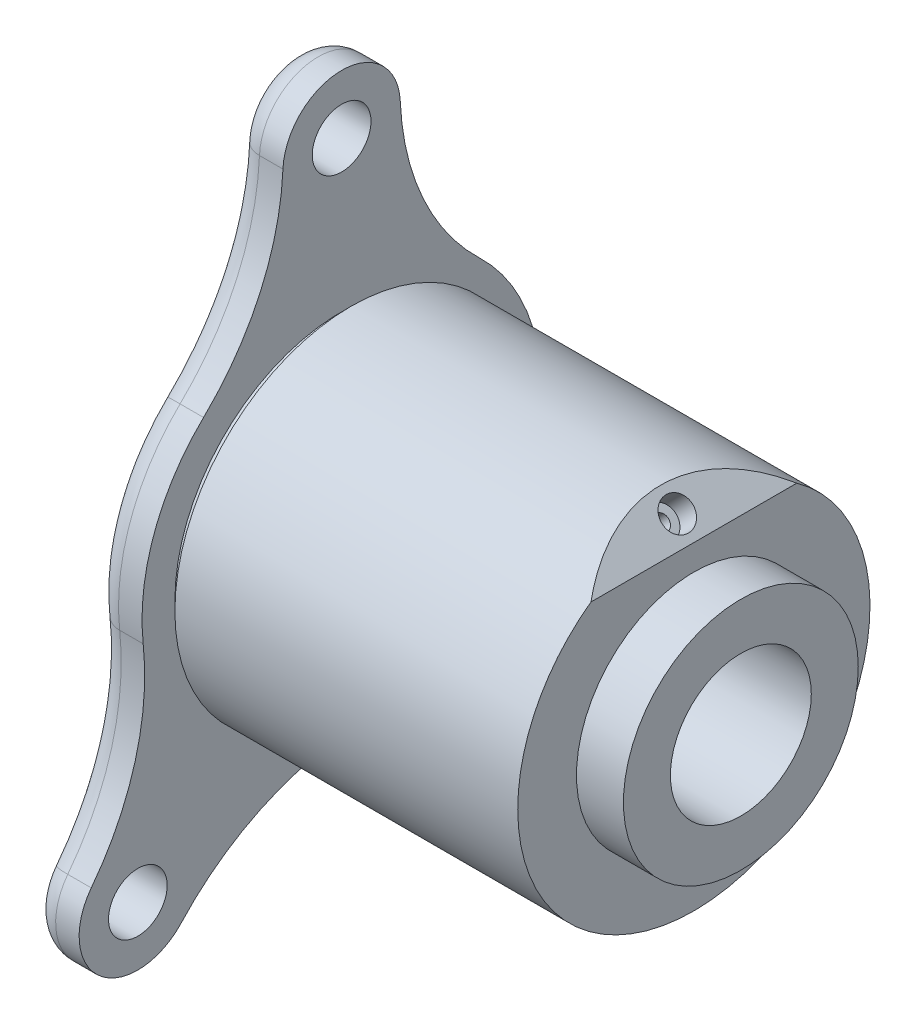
ISO-10303-21;
HEADER;
FILE_DESCRIPTION(('STEP AP214'),'2;1');
FILE_NAME('part.step','',(''),(''),'','','');
FILE_SCHEMA(('AUTOMOTIVE_DESIGN { 1 0 10303 214 1 1 1 1 }'));
ENDSEC;
DATA;
#1=APPLICATION_CONTEXT('core data for automotive mechanical design processes');
#2=APPLICATION_PROTOCOL_DEFINITION('international standard','automotive_design',2000,#1);
#3=PRODUCT_CONTEXT('',#1,'mechanical');
#4=PRODUCT('Part','Part','',(#3));
#5=PRODUCT_RELATED_PRODUCT_CATEGORY('part','',(#4));
#6=PRODUCT_DEFINITION_FORMATION('','',#4);
#7=PRODUCT_DEFINITION_CONTEXT('part definition',#1,'design');
#8=PRODUCT_DEFINITION('design','',#6,#7);
#9=PRODUCT_DEFINITION_SHAPE('','',#8);
#10=(LENGTH_UNIT() NAMED_UNIT(*) SI_UNIT(.MILLI.,.METRE.));
#11=(NAMED_UNIT(*) PLANE_ANGLE_UNIT() SI_UNIT($,.RADIAN.));
#12=(NAMED_UNIT(*) SI_UNIT($,.STERADIAN.) SOLID_ANGLE_UNIT());
#13=UNCERTAINTY_MEASURE_WITH_UNIT(LENGTH_MEASURE(1.E-05),#10,'distance_accuracy_value','');
#14=(GEOMETRIC_REPRESENTATION_CONTEXT(3) GLOBAL_UNCERTAINTY_ASSIGNED_CONTEXT((#13)) GLOBAL_UNIT_ASSIGNED_CONTEXT((#10,
#11,#12)) REPRESENTATION_CONTEXT('',''));
#15=CARTESIAN_POINT('',(0.,0.,0.));
#16=DIRECTION('',(0.,0.,1.));
#17=DIRECTION('',(1.,0.,0.));
#18=AXIS2_PLACEMENT_3D('',#15,#16,#17);
#19=CARTESIAN_POINT('',(75.,0.,0.));
#20=DIRECTION('',(-1.,0.,0.));
#21=DIRECTION('',(0.,0.,1.));
#22=AXIS2_PLACEMENT_3D('',#19,#20,#21);
#23=CYLINDRICAL_SURFACE('',#22,37.5);
#24=CARTESIAN_POINT('',(2.,0.,0.));
#25=DIRECTION('',(-1.,0.,0.));
#26=DIRECTION('',(0.,0.,1.));
#27=AXIS2_PLACEMENT_3D('',#24,#25,#26);
#28=CIRCLE('',#27,37.5);
#29=CARTESIAN_POINT('',(2.,0.,37.5));
#30=VERTEX_POINT('',#29);
#31=EDGE_CURVE('E365',#30,#30,#28,.T.);
#32=ORIENTED_EDGE('',*,*,#31,.F.);
#33=EDGE_LOOP('',(#32));
#34=FACE_BOUND('',#33,.T.);
#35=CARTESIAN_POINT('',(75.,0.,0.));
#36=DIRECTION('',(1.,0.,0.));
#37=DIRECTION('',(0.,0.,-1.));
#38=AXIS2_PLACEMENT_3D('',#35,#36,#37);
#39=CIRCLE('',#38,37.5);
#40=CARTESIAN_POINT('',(75.,30.4289321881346,21.9164341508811));
#41=VERTEX_POINT('',#40);
#42=CARTESIAN_POINT('',(75.,30.4289321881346,-21.9164341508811));
#43=VERTEX_POINT('',#42);
#44=EDGE_CURVE('E124',#41,#43,#39,.T.);
#45=ORIENTED_EDGE('',*,*,#44,.F.);
#46=CARTESIAN_POINT('',(105.428932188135,0.,0.));
#47=DIRECTION('',(0.707106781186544,0.707106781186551,0.));
#48=DIRECTION('',(-0.707106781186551,0.707106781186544,0.));
#49=AXIS2_PLACEMENT_3D('',#46,#47,#48);
#50=ELLIPSE('',#49,53.0330085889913,37.5);
#51=EDGE_CURVE('E41',#43,#41,#50,.T.);
#52=ORIENTED_EDGE('',*,*,#51,.F.);
#53=EDGE_LOOP('',(#45,#52));
#54=FACE_BOUND('',#53,.T.);
#55=ADVANCED_FACE('F28',(#34,#54),#23,.T.);
#56=CARTESIAN_POINT('',(75.,0.,0.));
#57=DIRECTION('',(1.,0.,0.));
#58=DIRECTION('',(0.,0.,-1.));
#59=AXIS2_PLACEMENT_3D('',#56,#57,#58);
#60=PLANE('',#59);
#61=CARTESIAN_POINT('',(75.,0.,0.));
#62=DIRECTION('',(1.,0.,0.));
#63=DIRECTION('',(0.,0.,-1.));
#64=AXIS2_PLACEMENT_3D('',#61,#62,#63);
#65=CIRCLE('',#64,25.);
#66=CARTESIAN_POINT('',(75.,0.,-25.));
#67=VERTEX_POINT('',#66);
#68=EDGE_CURVE('E136',#67,#67,#65,.T.);
#69=ORIENTED_EDGE('',*,*,#68,.F.);
#70=EDGE_LOOP('',(#69));
#71=FACE_BOUND('',#70,.T.);
#72=ORIENTED_EDGE('',*,*,#44,.T.);
#73=DIRECTION('',(0.,0.,1.));
#74=VECTOR('',#73,1.);
#75=CARTESIAN_POINT('',(75.,30.4289321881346,0.));
#76=LINE('',#75,#74);
#77=EDGE_CURVE('E11',#43,#41,#76,.T.);
#78=ORIENTED_EDGE('',*,*,#77,.T.);
#79=EDGE_LOOP('',(#72,#78));
#80=FACE_BOUND('',#79,.T.);
#81=ADVANCED_FACE('F128',(#71,#80),#60,.T.);
#82=CARTESIAN_POINT('',(-10.,35.2083333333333,33.7184780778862));
#83=DIRECTION('',(-1.,0.,0.));
#84=DIRECTION('',(0.,0.,1.));
#85=AXIS2_PLACEMENT_3D('',#82,#83,#84);
#86=PLANE('',#85);
#87=CARTESIAN_POINT('',(-10.,0.,0.));
#88=DIRECTION('',(-1.,0.,0.));
#89=DIRECTION('',(0.,0.,1.));
#90=AXIS2_PLACEMENT_3D('',#87,#88,#89);
#91=CIRCLE('',#90,37.5);
#92=CARTESIAN_POINT('',(-10.,27.0833333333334,-25.9372908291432));
#93=VERTEX_POINT('',#92);
#94=CARTESIAN_POINT('',(-10.,-37.4192061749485,-2.46028641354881));
#95=VERTEX_POINT('',#94);
#96=EDGE_CURVE('E149',#93,#95,#91,.T.);
#97=ORIENTED_EDGE('',*,*,#96,.T.);
#98=CARTESIAN_POINT('',(-10.,-97.2899360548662,-6.39674467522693));
#99=DIRECTION('',(-1.,0.,0.));
#100=DIRECTION('',(0.,0.,1.));
#101=AXIS2_PLACEMENT_3D('',#98,#99,#100);
#102=CIRCLE('',#101,60.);
#103=CARTESIAN_POINT('',(-10.,-56.7726594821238,37.8565071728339));
#104=VERTEX_POINT('',#103);
#105=EDGE_CURVE('E153',#95,#104,#102,.F.);
#106=ORIENTED_EDGE('',*,*,#105,.T.);
#107=CARTESIAN_POINT('',(-10.,-51.707999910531,43.3881636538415));
#108=DIRECTION('',(-1.,0.,0.));
#109=DIRECTION('',(0.,0.,1.));
#110=AXIS2_PLACEMENT_3D('',#107,#108,#109);
#111=CIRCLE('',#110,7.5);
#112=CARTESIAN_POINT('',(-10.,-47.1398506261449,49.33644173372));
#113=VERTEX_POINT('',#112);
#114=EDGE_CURVE('E151',#104,#113,#111,.T.);
#115=ORIENTED_EDGE('',*,*,#114,.T.);
#116=CARTESIAN_POINT('',(-10.,-10.5946563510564,96.922666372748));
#117=DIRECTION('',(-1.,0.,0.));
#118=DIRECTION('',(0.,0.,1.));
#119=AXIS2_PLACEMENT_3D('',#116,#117,#118);
#120=CIRCLE('',#119,60.);
#121=CARTESIAN_POINT('',(-10.,-4.0748678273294,37.2779486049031));
#122=VERTEX_POINT('',#121);
#123=EDGE_CURVE('E147',#113,#122,#120,.F.);
#124=ORIENTED_EDGE('',*,*,#123,.T.);
#125=CARTESIAN_POINT('',(-10.,0.,0.));
#126=DIRECTION('',(-1.,0.,0.));
#127=DIRECTION('',(0.,0.,1.));
#128=AXIS2_PLACEMENT_3D('',#125,#126,#127);
#129=CIRCLE('',#128,37.5);
#130=CARTESIAN_POINT('',(-10.,27.0833333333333,25.9372908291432));
#131=VERTEX_POINT('',#130);
#132=EDGE_CURVE('E143',#122,#131,#129,.T.);
#133=ORIENTED_EDGE('',*,*,#132,.T.);
#134=CARTESIAN_POINT('',(-10.,70.4166666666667,67.4369561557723));
#135=DIRECTION('',(-1.,0.,0.));
#136=DIRECTION('',(0.,0.,1.));
#137=AXIS2_PLACEMENT_3D('',#134,#135,#136);
#138=CIRCLE('',#137,60.);
#139=CARTESIAN_POINT('',(-10.,67.8240740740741,7.49299512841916));
#140=VERTEX_POINT('',#139);
#141=EDGE_CURVE('E133',#131,#140,#138,.F.);
#142=ORIENTED_EDGE('',*,*,#141,.T.);
#143=CARTESIAN_POINT('',(-10.,67.5,0.));
#144=DIRECTION('',(-1.,0.,0.));
#145=DIRECTION('',(0.,0.,1.));
#146=AXIS2_PLACEMENT_3D('',#143,#144,#145);
#147=CIRCLE('',#146,7.5);
#148=CARTESIAN_POINT('',(-10.,67.8240740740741,-7.49299512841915));
#149=VERTEX_POINT('',#148);
#150=EDGE_CURVE('E141',#140,#149,#147,.T.);
#151=ORIENTED_EDGE('',*,*,#150,.T.);
#152=CARTESIAN_POINT('',(-10.,70.4166666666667,-67.4369561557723));
#153=DIRECTION('',(-1.,0.,0.));
#154=DIRECTION('',(0.,0.,1.));
#155=AXIS2_PLACEMENT_3D('',#152,#153,#154);
#156=CIRCLE('',#155,60.);
#157=EDGE_CURVE('E145',#149,#93,#156,.F.);
#158=ORIENTED_EDGE('',*,*,#157,.T.);
#159=EDGE_LOOP('',(#97,#106,#115,#124,#133,#142,#151,#158));
#160=FACE_BOUND('',#159,.T.);
#161=CARTESIAN_POINT('',(-10.,0.,0.));
#162=DIRECTION('',(-1.,0.,0.));
#163=DIRECTION('',(0.,0.,1.));
#164=AXIS2_PLACEMENT_3D('',#161,#162,#163);
#165=CIRCLE('',#164,29.3301270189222);
#166=CARTESIAN_POINT('',(-10.,0.,29.3301270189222));
#167=VERTEX_POINT('',#166);
#168=EDGE_CURVE('E129',#167,#167,#165,.F.);
#169=ORIENTED_EDGE('',*,*,#168,.T.);
#170=EDGE_LOOP('',(#169));
#171=FACE_BOUND('',#170,.T.);
#172=CARTESIAN_POINT('',(-10.,67.5,0.));
#173=DIRECTION('',(1.,0.,0.));
#174=DIRECTION('',(0.,0.,-1.));
#175=AXIS2_PLACEMENT_3D('',#172,#173,#174);
#176=CIRCLE('',#175,6.25);
#177=CARTESIAN_POINT('',(-10.,67.5,-6.25));
#178=VERTEX_POINT('',#177);
#179=EDGE_CURVE('E392',#178,#178,#176,.T.);
#180=ORIENTED_EDGE('',*,*,#179,.T.);
#181=EDGE_LOOP('',(#180));
#182=FACE_BOUND('',#181,.T.);
#183=CARTESIAN_POINT('',(-10.,-51.707999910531,43.3881636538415));
#184=DIRECTION('',(1.,0.,0.));
#185=DIRECTION('',(0.,0.,-1.));
#186=AXIS2_PLACEMENT_3D('',#183,#184,#185);
#187=CIRCLE('',#186,6.24999999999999);
#188=CARTESIAN_POINT('',(-10.,-51.707999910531,37.1381636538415));
#189=VERTEX_POINT('',#188);
#190=EDGE_CURVE('E386',#189,#189,#187,.T.);
#191=ORIENTED_EDGE('',*,*,#190,.T.);
#192=EDGE_LOOP('',(#191));
#193=FACE_BOUND('',#192,.T.);
#194=ADVANCED_FACE('F242',(#160,#171,#182,#193),#86,.T.);
#195=CARTESIAN_POINT('',(85.,0.,0.));
#196=DIRECTION('',(-1.,0.,0.));
#197=DIRECTION('',(0.,0.,1.));
#198=AXIS2_PLACEMENT_3D('',#195,#196,#197);
#199=CYLINDRICAL_SURFACE('',#198,25.);
#200=CARTESIAN_POINT('',(85.,0.,0.));
#201=DIRECTION('',(1.,0.,0.));
#202=DIRECTION('',(0.,0.,-1.));
#203=AXIS2_PLACEMENT_3D('',#200,#201,#202);
#204=CIRCLE('',#203,25.);
#205=CARTESIAN_POINT('',(85.,0.,-25.));
#206=VERTEX_POINT('',#205);
#207=EDGE_CURVE('E130',#206,#206,#204,.T.);
#208=ORIENTED_EDGE('',*,*,#207,.F.);
#209=EDGE_LOOP('',(#208));
#210=FACE_BOUND('',#209,.T.);
#211=ORIENTED_EDGE('',*,*,#68,.T.);
#212=EDGE_LOOP('',(#211));
#213=FACE_BOUND('',#212,.T.);
#214=ADVANCED_FACE('F239',(#210,#213),#199,.T.);
#215=CARTESIAN_POINT('',(85.,0.,0.));
#216=DIRECTION('',(1.,0.,0.));
#217=DIRECTION('',(0.,0.,-1.));
#218=AXIS2_PLACEMENT_3D('',#215,#216,#217);
#219=PLANE('',#218);
#220=CARTESIAN_POINT('',(85.,0.,0.));
#221=DIRECTION('',(1.,0.,0.));
#222=DIRECTION('',(0.,0.,-1.));
#223=AXIS2_PLACEMENT_3D('',#220,#221,#222);
#224=CIRCLE('',#223,15.);
#225=CARTESIAN_POINT('',(85.,0.,-15.));
#226=VERTEX_POINT('',#225);
#227=EDGE_CURVE('E374',#226,#226,#224,.T.);
#228=ORIENTED_EDGE('',*,*,#227,.F.);
#229=EDGE_LOOP('',(#228));
#230=FACE_BOUND('',#229,.T.);
#231=ORIENTED_EDGE('',*,*,#207,.T.);
#232=EDGE_LOOP('',(#231));
#233=FACE_BOUND('',#232,.T.);
#234=ADVANCED_FACE('F254',(#230,#233),#219,.T.);
#235=CARTESIAN_POINT('',(0.,35.2083333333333,33.7184780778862));
#236=DIRECTION('',(-1.,0.,0.));
#237=DIRECTION('',(0.,0.,1.));
#238=AXIS2_PLACEMENT_3D('',#235,#236,#237);
#239=PLANE('',#238);
#240=CARTESIAN_POINT('',(0.,-51.707999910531,43.3881636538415));
#241=DIRECTION('',(1.,0.,0.));
#242=DIRECTION('',(0.,0.,-1.));
#243=AXIS2_PLACEMENT_3D('',#240,#241,#242);
#244=CIRCLE('',#243,6.24999999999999);
#245=CARTESIAN_POINT('',(0.,-51.707999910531,37.1381636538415));
#246=VERTEX_POINT('',#245);
#247=EDGE_CURVE('E383',#246,#246,#244,.T.);
#248=ORIENTED_EDGE('',*,*,#247,.F.);
#249=EDGE_LOOP('',(#248));
#250=FACE_BOUND('',#249,.T.);
#251=CARTESIAN_POINT('',(0.,67.5,0.));
#252=DIRECTION('',(1.,0.,0.));
#253=DIRECTION('',(0.,0.,-1.));
#254=AXIS2_PLACEMENT_3D('',#251,#252,#253);
#255=CIRCLE('',#254,6.25);
#256=CARTESIAN_POINT('',(0.,67.5,-6.25));
#257=VERTEX_POINT('',#256);
#258=EDGE_CURVE('E389',#257,#257,#255,.T.);
#259=ORIENTED_EDGE('',*,*,#258,.F.);
#260=EDGE_LOOP('',(#259));
#261=FACE_BOUND('',#260,.T.);
#262=CARTESIAN_POINT('',(0.,70.4166666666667,67.4369561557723));
#263=DIRECTION('',(1.,0.,0.));
#264=DIRECTION('',(0.,0.,1.));
#265=AXIS2_PLACEMENT_3D('',#262,#263,#264);
#266=CIRCLE('',#265,55.);
#267=CARTESIAN_POINT('',(0.,30.6944444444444,29.395596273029));
#268=VERTEX_POINT('',#267);
#269=CARTESIAN_POINT('',(0.,68.0401234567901,12.4883252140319));
#270=VERTEX_POINT('',#269);
#271=EDGE_CURVE('E395',#268,#270,#266,.T.);
#272=ORIENTED_EDGE('',*,*,#271,.F.);
#273=CARTESIAN_POINT('',(0.,0.,0.));
#274=DIRECTION('',(-1.,0.,0.));
#275=DIRECTION('',(0.,0.,1.));
#276=AXIS2_PLACEMENT_3D('',#273,#274,#275);
#277=CIRCLE('',#276,42.5);
#278=CARTESIAN_POINT('',(0.,-4.61818353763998,42.2483417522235));
#279=VERTEX_POINT('',#278);
#280=EDGE_CURVE('E186',#279,#268,#277,.T.);
#281=ORIENTED_EDGE('',*,*,#280,.F.);
#282=CARTESIAN_POINT('',(0.,-10.5946563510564,96.922666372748));
#283=DIRECTION('',(1.,0.,0.));
#284=DIRECTION('',(0.,0.,1.));
#285=AXIS2_PLACEMENT_3D('',#282,#283,#284);
#286=CIRCLE('',#285,55.);
#287=CARTESIAN_POINT('',(0.,-44.0944177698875,53.301960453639));
#288=VERTEX_POINT('',#287);
#289=EDGE_CURVE('E410',#288,#279,#286,.T.);
#290=ORIENTED_EDGE('',*,*,#289,.F.);
#291=CARTESIAN_POINT('',(0.,-51.707999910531,43.3881636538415));
#292=DIRECTION('',(-1.,0.,0.));
#293=DIRECTION('',(0.,0.,1.));
#294=AXIS2_PLACEMENT_3D('',#291,#292,#293);
#295=CIRCLE('',#294,12.5);
#296=CARTESIAN_POINT('',(0.,-60.149099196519,34.1687361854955));
#297=VERTEX_POINT('',#296);
#298=EDGE_CURVE('E223',#297,#288,#295,.T.);
#299=ORIENTED_EDGE('',*,*,#298,.F.);
#300=CARTESIAN_POINT('',(0.,-97.2899360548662,-6.39674467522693));
#301=DIRECTION('',(1.,0.,0.));
#302=DIRECTION('',(0.,0.,1.));
#303=AXIS2_PLACEMENT_3D('',#300,#301,#302);
#304=CIRCLE('',#303,55.);
#305=CARTESIAN_POINT('',(0.,-42.4084336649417,-2.78832460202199));
#306=VERTEX_POINT('',#305);
#307=EDGE_CURVE('E406',#306,#297,#304,.T.);
#308=ORIENTED_EDGE('',*,*,#307,.F.);
#309=CARTESIAN_POINT('',(0.,0.,0.));
#310=DIRECTION('',(-1.,0.,0.));
#311=DIRECTION('',(0.,0.,1.));
#312=AXIS2_PLACEMENT_3D('',#309,#310,#311);
#313=CIRCLE('',#312,42.5);
#314=CARTESIAN_POINT('',(0.,30.6944444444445,-29.3955962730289));
#315=VERTEX_POINT('',#314);
#316=EDGE_CURVE('E403',#315,#306,#313,.T.);
#317=ORIENTED_EDGE('',*,*,#316,.F.);
#318=CARTESIAN_POINT('',(0.,70.4166666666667,-67.4369561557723));
#319=DIRECTION('',(1.,0.,0.));
#320=DIRECTION('',(0.,0.,-1.));
#321=AXIS2_PLACEMENT_3D('',#318,#319,#320);
#322=CIRCLE('',#321,55.);
#323=CARTESIAN_POINT('',(0.,68.0401234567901,-12.4883252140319));
#324=VERTEX_POINT('',#323);
#325=EDGE_CURVE('E400',#324,#315,#322,.T.);
#326=ORIENTED_EDGE('',*,*,#325,.F.);
#327=CARTESIAN_POINT('',(0.,67.5,0.));
#328=DIRECTION('',(-1.,0.,0.));
#329=DIRECTION('',(0.,0.,1.));
#330=AXIS2_PLACEMENT_3D('',#327,#328,#329);
#331=CIRCLE('',#330,12.5);
#332=EDGE_CURVE('E397',#270,#324,#331,.T.);
#333=ORIENTED_EDGE('',*,*,#332,.F.);
#334=EDGE_LOOP('',(#272,#281,#290,#299,#308,#317,#326,#333));
#335=FACE_BOUND('',#334,.T.);
#336=CARTESIAN_POINT('',(0.,0.,0.));
#337=DIRECTION('',(-1.,0.,0.));
#338=DIRECTION('',(0.,0.,1.));
#339=AXIS2_PLACEMENT_3D('',#336,#337,#338);
#340=CIRCLE('',#339,35.5);
#341=CARTESIAN_POINT('',(0.,0.,35.5));
#342=VERTEX_POINT('',#341);
#343=EDGE_CURVE('E368',#342,#342,#340,.T.);
#344=ORIENTED_EDGE('',*,*,#343,.T.);
#345=EDGE_LOOP('',(#344));
#346=FACE_BOUND('',#345,.T.);
#347=ADVANCED_FACE('F258',(#250,#261,#335,#346),#239,.F.);
#348=CARTESIAN_POINT('',(-10.,70.4166666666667,67.4369561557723));
#349=DIRECTION('',(1.,0.,0.));
#350=DIRECTION('',(0.,0.,-1.));
#351=AXIS2_PLACEMENT_3D('',#348,#349,#350);
#352=CYLINDRICAL_SURFACE('',#351,55.);
#353=DIRECTION('',(1.,0.,0.));
#354=VECTOR('',#353,1.);
#355=CARTESIAN_POINT('',(-10.,68.0401234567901,12.4883252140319));
#356=LINE('',#355,#354);
#357=CARTESIAN_POINT('',(-5.,68.0401234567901,12.4883252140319));
#358=VERTEX_POINT('',#357);
#359=EDGE_CURVE('E176',#358,#270,#356,.T.);
#360=ORIENTED_EDGE('',*,*,#359,.F.);
#361=CARTESIAN_POINT('',(-5.,70.4166666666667,67.4369561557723));
#362=DIRECTION('',(-1.,0.,0.));
#363=DIRECTION('',(0.,0.,1.));
#364=AXIS2_PLACEMENT_3D('',#361,#362,#363);
#365=CIRCLE('',#364,55.);
#366=CARTESIAN_POINT('',(-5.,30.6944444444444,29.395596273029));
#367=VERTEX_POINT('',#366);
#368=EDGE_CURVE('E35',#358,#367,#365,.T.);
#369=ORIENTED_EDGE('',*,*,#368,.T.);
#370=DIRECTION('',(1.,0.,0.));
#371=VECTOR('',#370,1.);
#372=CARTESIAN_POINT('',(-10.,30.6944444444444,29.395596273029));
#373=LINE('',#372,#371);
#374=EDGE_CURVE('E174',#367,#268,#373,.T.);
#375=ORIENTED_EDGE('',*,*,#374,.T.);
#376=ORIENTED_EDGE('',*,*,#271,.T.);
#377=EDGE_LOOP('',(#360,#369,#375,#376));
#378=FACE_BOUND('',#377,.T.);
#379=ADVANCED_FACE('F172',(#378),#352,.F.);
#380=CARTESIAN_POINT('',(-10.,67.5,0.));
#381=DIRECTION('',(1.,0.,0.));
#382=DIRECTION('',(0.,0.,-1.));
#383=AXIS2_PLACEMENT_3D('',#380,#381,#382);
#384=CYLINDRICAL_SURFACE('',#383,12.5);
#385=DIRECTION('',(1.,0.,0.));
#386=VECTOR('',#385,1.);
#387=CARTESIAN_POINT('',(-10.,68.0401234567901,-12.4883252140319));
#388=LINE('',#387,#386);
#389=CARTESIAN_POINT('',(-5.,68.0401234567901,-12.4883252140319));
#390=VERTEX_POINT('',#389);
#391=EDGE_CURVE('E234',#390,#324,#388,.T.);
#392=ORIENTED_EDGE('',*,*,#391,.F.);
#393=CARTESIAN_POINT('',(-5.,67.5,0.));
#394=DIRECTION('',(-1.,0.,0.));
#395=DIRECTION('',(0.,0.,1.));
#396=AXIS2_PLACEMENT_3D('',#393,#394,#395);
#397=CIRCLE('',#396,12.5);
#398=EDGE_CURVE('E48',#390,#358,#397,.F.);
#399=ORIENTED_EDGE('',*,*,#398,.T.);
#400=ORIENTED_EDGE('',*,*,#359,.T.);
#401=ORIENTED_EDGE('',*,*,#332,.T.);
#402=EDGE_LOOP('',(#392,#399,#400,#401));
#403=FACE_BOUND('',#402,.T.);
#404=ADVANCED_FACE('F262',(#403),#384,.T.);
#405=CARTESIAN_POINT('',(-10.,70.4166666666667,-67.4369561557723));
#406=DIRECTION('',(1.,0.,0.));
#407=DIRECTION('',(0.,0.,-1.));
#408=AXIS2_PLACEMENT_3D('',#405,#406,#407);
#409=CYLINDRICAL_SURFACE('',#408,55.);
#410=DIRECTION('',(1.,0.,0.));
#411=VECTOR('',#410,1.);
#412=CARTESIAN_POINT('',(-10.,30.6944444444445,-29.3955962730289));
#413=LINE('',#412,#411);
#414=CARTESIAN_POINT('',(-5.,30.6944444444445,-29.3955962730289));
#415=VERTEX_POINT('',#414);
#416=EDGE_CURVE('E232',#415,#315,#413,.T.);
#417=ORIENTED_EDGE('',*,*,#416,.F.);
#418=CARTESIAN_POINT('',(-5.,70.4166666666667,-67.4369561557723));
#419=DIRECTION('',(-1.,0.,0.));
#420=DIRECTION('',(0.,0.,1.));
#421=AXIS2_PLACEMENT_3D('',#418,#419,#420);
#422=CIRCLE('',#421,55.);
#423=EDGE_CURVE('E165',#415,#390,#422,.T.);
#424=ORIENTED_EDGE('',*,*,#423,.T.);
#425=ORIENTED_EDGE('',*,*,#391,.T.);
#426=ORIENTED_EDGE('',*,*,#325,.T.);
#427=EDGE_LOOP('',(#417,#424,#425,#426));
#428=FACE_BOUND('',#427,.T.);
#429=ADVANCED_FACE('F265',(#428),#409,.F.);
#430=CARTESIAN_POINT('',(-10.,0.,0.));
#431=DIRECTION('',(1.,0.,0.));
#432=DIRECTION('',(0.,0.,-1.));
#433=AXIS2_PLACEMENT_3D('',#430,#431,#432);
#434=CYLINDRICAL_SURFACE('',#433,42.5);
#435=DIRECTION('',(1.,0.,0.));
#436=VECTOR('',#435,1.);
#437=CARTESIAN_POINT('',(-10.,-42.4084336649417,-2.78832460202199));
#438=LINE('',#437,#436);
#439=CARTESIAN_POINT('',(-5.,-42.4084336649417,-2.78832460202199));
#440=VERTEX_POINT('',#439);
#441=EDGE_CURVE('E227',#440,#306,#438,.T.);
#442=ORIENTED_EDGE('',*,*,#441,.F.);
#443=CARTESIAN_POINT('',(-5.,0.,0.));
#444=DIRECTION('',(-1.,0.,0.));
#445=DIRECTION('',(0.,0.,1.));
#446=AXIS2_PLACEMENT_3D('',#443,#444,#445);
#447=CIRCLE('',#446,42.5);
#448=EDGE_CURVE('E161',#440,#415,#447,.F.);
#449=ORIENTED_EDGE('',*,*,#448,.T.);
#450=ORIENTED_EDGE('',*,*,#416,.T.);
#451=ORIENTED_EDGE('',*,*,#316,.T.);
#452=EDGE_LOOP('',(#442,#449,#450,#451));
#453=FACE_BOUND('',#452,.T.);
#454=ADVANCED_FACE('F268',(#453),#434,.T.);
#455=CARTESIAN_POINT('',(-10.,-97.2899360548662,-6.39674467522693));
#456=DIRECTION('',(1.,0.,0.));
#457=DIRECTION('',(0.,0.,-1.));
#458=AXIS2_PLACEMENT_3D('',#455,#456,#457);
#459=CYLINDRICAL_SURFACE('',#458,55.);
#460=DIRECTION('',(1.,0.,0.));
#461=VECTOR('',#460,1.);
#462=CARTESIAN_POINT('',(-10.,-60.149099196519,34.1687361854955));
#463=LINE('',#462,#461);
#464=CARTESIAN_POINT('',(-5.,-60.149099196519,34.1687361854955));
#465=VERTEX_POINT('',#464);
#466=EDGE_CURVE('E225',#465,#297,#463,.T.);
#467=ORIENTED_EDGE('',*,*,#466,.F.);
#468=CARTESIAN_POINT('',(-5.,-97.2899360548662,-6.39674467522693));
#469=DIRECTION('',(-1.,0.,0.));
#470=DIRECTION('',(0.,0.,1.));
#471=AXIS2_PLACEMENT_3D('',#468,#469,#470);
#472=CIRCLE('',#471,55.);
#473=EDGE_CURVE('E156',#465,#440,#472,.T.);
#474=ORIENTED_EDGE('',*,*,#473,.T.);
#475=ORIENTED_EDGE('',*,*,#441,.T.);
#476=ORIENTED_EDGE('',*,*,#307,.T.);
#477=EDGE_LOOP('',(#467,#474,#475,#476));
#478=FACE_BOUND('',#477,.T.);
#479=ADVANCED_FACE('F272',(#478),#459,.F.);
#480=CARTESIAN_POINT('',(-10.,-51.707999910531,43.3881636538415));
#481=DIRECTION('',(1.,0.,0.));
#482=DIRECTION('',(0.,0.,-1.));
#483=AXIS2_PLACEMENT_3D('',#480,#481,#482);
#484=CYLINDRICAL_SURFACE('',#483,12.5);
#485=DIRECTION('',(1.,0.,0.));
#486=VECTOR('',#485,1.);
#487=CARTESIAN_POINT('',(-10.,-44.0944177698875,53.301960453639));
#488=LINE('',#487,#486);
#489=CARTESIAN_POINT('',(-5.,-44.0944177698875,53.301960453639));
#490=VERTEX_POINT('',#489);
#491=EDGE_CURVE('E217',#490,#288,#488,.T.);
#492=ORIENTED_EDGE('',*,*,#491,.F.);
#493=CARTESIAN_POINT('',(-5.,-51.707999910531,43.3881636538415));
#494=DIRECTION('',(-1.,0.,0.));
#495=DIRECTION('',(0.,0.,1.));
#496=AXIS2_PLACEMENT_3D('',#493,#494,#495);
#497=CIRCLE('',#496,12.5);
#498=EDGE_CURVE('E159',#490,#465,#497,.F.);
#499=ORIENTED_EDGE('',*,*,#498,.T.);
#500=ORIENTED_EDGE('',*,*,#466,.T.);
#501=ORIENTED_EDGE('',*,*,#298,.T.);
#502=EDGE_LOOP('',(#492,#499,#500,#501));
#503=FACE_BOUND('',#502,.T.);
#504=ADVANCED_FACE('F220',(#503),#484,.T.);
#505=CARTESIAN_POINT('',(-10.,-10.5946563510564,96.922666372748));
#506=DIRECTION('',(1.,0.,0.));
#507=DIRECTION('',(0.,0.,-1.));
#508=AXIS2_PLACEMENT_3D('',#505,#506,#507);
#509=CYLINDRICAL_SURFACE('',#508,55.);
#510=DIRECTION('',(1.,0.,0.));
#511=VECTOR('',#510,1.);
#512=CARTESIAN_POINT('',(-10.,-4.61818353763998,42.2483417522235));
#513=LINE('',#512,#511);
#514=CARTESIAN_POINT('',(-5.,-4.61818353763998,42.2483417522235));
#515=VERTEX_POINT('',#514);
#516=EDGE_CURVE('E188',#515,#279,#513,.T.);
#517=ORIENTED_EDGE('',*,*,#516,.F.);
#518=CARTESIAN_POINT('',(-5.,-10.5946563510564,96.922666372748));
#519=DIRECTION('',(-1.,0.,0.));
#520=DIRECTION('',(0.,0.,1.));
#521=AXIS2_PLACEMENT_3D('',#518,#519,#520);
#522=CIRCLE('',#521,55.);
#523=EDGE_CURVE('E163',#515,#490,#522,.T.);
#524=ORIENTED_EDGE('',*,*,#523,.T.);
#525=ORIENTED_EDGE('',*,*,#491,.T.);
#526=ORIENTED_EDGE('',*,*,#289,.T.);
#527=EDGE_LOOP('',(#517,#524,#525,#526));
#528=FACE_BOUND('',#527,.T.);
#529=ADVANCED_FACE('F215',(#528),#509,.F.);
#530=CARTESIAN_POINT('',(-10.,0.,0.));
#531=DIRECTION('',(1.,0.,0.));
#532=DIRECTION('',(0.,0.,-1.));
#533=AXIS2_PLACEMENT_3D('',#530,#531,#532);
#534=CYLINDRICAL_SURFACE('',#533,42.5);
#535=ORIENTED_EDGE('',*,*,#374,.F.);
#536=CARTESIAN_POINT('',(-5.,0.,0.));
#537=DIRECTION('',(-1.,0.,0.));
#538=DIRECTION('',(0.,0.,1.));
#539=AXIS2_PLACEMENT_3D('',#536,#537,#538);
#540=CIRCLE('',#539,42.5);
#541=EDGE_CURVE('E167',#367,#515,#540,.F.);
#542=ORIENTED_EDGE('',*,*,#541,.T.);
#543=ORIENTED_EDGE('',*,*,#516,.T.);
#544=ORIENTED_EDGE('',*,*,#280,.T.);
#545=EDGE_LOOP('',(#535,#542,#543,#544));
#546=FACE_BOUND('',#545,.T.);
#547=ADVANCED_FACE('F182',(#546),#534,.T.);
#548=CARTESIAN_POINT('',(-10.,67.5,0.));
#549=DIRECTION('',(1.,0.,0.));
#550=DIRECTION('',(0.,0.,-1.));
#551=AXIS2_PLACEMENT_3D('',#548,#549,#550);
#552=CYLINDRICAL_SURFACE('',#551,6.25);
#553=ORIENTED_EDGE('',*,*,#179,.F.);
#554=EDGE_LOOP('',(#553));
#555=FACE_BOUND('',#554,.T.);
#556=ORIENTED_EDGE('',*,*,#258,.T.);
#557=EDGE_LOOP('',(#556));
#558=FACE_BOUND('',#557,.T.);
#559=ADVANCED_FACE('F282',(#555,#558),#552,.F.);
#560=CARTESIAN_POINT('',(-10.,-51.707999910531,43.3881636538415));
#561=DIRECTION('',(1.,0.,0.));
#562=DIRECTION('',(0.,0.,-1.));
#563=AXIS2_PLACEMENT_3D('',#560,#561,#562);
#564=CYLINDRICAL_SURFACE('',#563,6.24999999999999);
#565=ORIENTED_EDGE('',*,*,#190,.F.);
#566=EDGE_LOOP('',(#565));
#567=FACE_BOUND('',#566,.T.);
#568=ORIENTED_EDGE('',*,*,#247,.T.);
#569=EDGE_LOOP('',(#568));
#570=FACE_BOUND('',#569,.T.);
#571=ADVANCED_FACE('F289',(#567,#570),#564,.F.);
#572=CARTESIAN_POINT('',(-12.5,0.,0.));
#573=DIRECTION('',(-1.,0.,0.));
#574=DIRECTION('',(0.,0.,1.));
#575=AXIS2_PLACEMENT_3D('',#572,#573,#574);
#576=PLANE('',#575);
#577=CARTESIAN_POINT('',(-12.5,0.,0.));
#578=DIRECTION('',(1.,0.,0.));
#579=DIRECTION('',(0.,0.,-1.));
#580=AXIS2_PLACEMENT_3D('',#577,#578,#579);
#581=CIRCLE('',#580,15.);
#582=CARTESIAN_POINT('',(-12.5,0.,-15.));
#583=VERTEX_POINT('',#582);
#584=EDGE_CURVE('E377',#583,#583,#581,.T.);
#585=ORIENTED_EDGE('',*,*,#584,.T.);
#586=EDGE_LOOP('',(#585));
#587=FACE_BOUND('',#586,.T.);
#588=CARTESIAN_POINT('',(-12.5,0.,0.));
#589=DIRECTION('',(-1.,0.,0.));
#590=DIRECTION('',(0.,0.,1.));
#591=AXIS2_PLACEMENT_3D('',#588,#589,#590);
#592=CIRCLE('',#591,25.);
#593=CARTESIAN_POINT('',(-12.5,0.,25.));
#594=VERTEX_POINT('',#593);
#595=EDGE_CURVE('E380',#594,#594,#592,.T.);
#596=ORIENTED_EDGE('',*,*,#595,.T.);
#597=EDGE_LOOP('',(#596));
#598=FACE_BOUND('',#597,.T.);
#599=ADVANCED_FACE('F293',(#587,#598),#576,.T.);
#600=CARTESIAN_POINT('',(-15.,0.,0.));
#601=DIRECTION('',(-1.,0.,0.));
#602=DIRECTION('',(0.,0.,1.));
#603=AXIS2_PLACEMENT_3D('',#600,#601,#602);
#604=TOROIDAL_SURFACE('',#603,29.3301270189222,5.);
#605=ORIENTED_EDGE('',*,*,#168,.F.);
#606=EDGE_LOOP('',(#605));
#607=FACE_BOUND('',#606,.T.);
#608=ORIENTED_EDGE('',*,*,#595,.F.);
#609=EDGE_LOOP('',(#608));
#610=FACE_BOUND('',#609,.T.);
#611=ADVANCED_FACE('F297',(#607,#610),#604,.F.);
#612=CARTESIAN_POINT('',(-12.5,0.,0.));
#613=DIRECTION('',(1.,0.,0.));
#614=DIRECTION('',(0.,0.,-1.));
#615=AXIS2_PLACEMENT_3D('',#612,#613,#614);
#616=CYLINDRICAL_SURFACE('',#615,15.);
#617=CARTESIAN_POINT('',(50.0958369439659,15.,0.));
#618=CARTESIAN_POINT('',(50.0958494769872,14.9999982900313,0.0788929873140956));
#619=CARTESIAN_POINT('',(50.1030398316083,14.9993690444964,0.157908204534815));
#620=CARTESIAN_POINT('',(50.1313707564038,14.9969270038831,0.313497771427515));
#621=CARTESIAN_POINT('',(50.152548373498,14.9951110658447,0.390065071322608));
#622=CARTESIAN_POINT('',(50.2073797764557,14.9905289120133,0.538048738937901));
#623=CARTESIAN_POINT('',(50.2409646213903,14.9877679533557,0.609491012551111));
#624=CARTESIAN_POINT('',(50.3188125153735,14.9815861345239,0.746169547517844));
#625=CARTESIAN_POINT('',(50.3630745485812,14.9781653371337,0.811406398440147));
#626=CARTESIAN_POINT('',(50.4756843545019,14.9698365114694,0.954256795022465));
#627=CARTESIAN_POINT('',(50.5472330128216,14.9647984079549,1.02934019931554));
#628=CARTESIAN_POINT('',(50.7016183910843,14.9547078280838,1.16682615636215));
#629=CARTESIAN_POINT('',(50.7844748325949,14.9496553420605,1.22920606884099));
#630=CARTESIAN_POINT('',(50.9862691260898,14.9384450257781,1.35957881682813));
#631=CARTESIAN_POINT('',(51.1082283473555,14.9324558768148,1.4228993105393));
#632=CARTESIAN_POINT('',(51.3607010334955,14.9219447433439,1.5291785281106));
#633=CARTESIAN_POINT('',(51.491226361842,14.9174248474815,1.57210830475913));
#634=CARTESIAN_POINT('',(51.7971066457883,14.9091106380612,1.64936892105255));
#635=CARTESIAN_POINT('',(51.9741180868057,14.9059454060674,1.67721026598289));
#636=CARTESIAN_POINT('',(52.3303230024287,14.9028991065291,1.70403043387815));
#637=CARTESIAN_POINT('',(52.5095189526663,14.9030221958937,1.70297272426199));
#638=CARTESIAN_POINT('',(52.8681161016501,14.9063963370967,1.67320376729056));
#639=CARTESIAN_POINT('',(53.0474874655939,14.9096895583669,1.64411970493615));
#640=CARTESIAN_POINT('',(53.3110456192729,14.9166448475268,1.57928391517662));
#641=CARTESIAN_POINT('',(53.3979761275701,14.9192989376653,1.55413946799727));
#642=CARTESIAN_POINT('',(53.5693541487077,14.9251852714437,1.49655918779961));
#643=CARTESIAN_POINT('',(53.6538026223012,14.9284172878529,1.46412621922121));
#644=CARTESIAN_POINT('',(53.8509741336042,14.936671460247,1.37782379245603));
#645=CARTESIAN_POINT('',(53.9622056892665,14.9419063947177,1.32049553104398));
#646=CARTESIAN_POINT('',(54.1750287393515,14.9528559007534,1.19011938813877));
#647=CARTESIAN_POINT('',(54.2766354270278,14.9585696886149,1.11709689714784));
#648=CARTESIAN_POINT('',(54.4385125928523,14.9682638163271,0.976986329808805));
#649=CARTESIAN_POINT('',(54.5023533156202,14.9722780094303,0.91404588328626));
#650=CARTESIAN_POINT('',(54.6196040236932,14.9799087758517,0.779030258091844));
#651=CARTESIAN_POINT('',(54.6730296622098,14.9835259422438,0.706969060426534));
#652=CARTESIAN_POINT('',(54.7556558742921,14.9892535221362,0.570830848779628));
#653=CARTESIAN_POINT('',(54.7875984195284,14.9915205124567,0.508435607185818));
#654=CARTESIAN_POINT('',(54.8408364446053,14.9953446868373,0.379210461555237));
#655=CARTESIAN_POINT('',(54.8621409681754,14.9969024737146,0.31238437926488));
#656=CARTESIAN_POINT('',(54.8924669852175,14.9991308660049,0.17545161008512));
#657=CARTESIAN_POINT('',(54.9014036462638,14.9997953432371,0.105325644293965));
#658=CARTESIAN_POINT('',(54.9058223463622,15.0001230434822,-0.0353485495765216));
#659=CARTESIAN_POINT('',(54.9013080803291,14.9997865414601,-0.105896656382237));
#660=CARTESIAN_POINT('',(54.8804621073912,14.9982477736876,-0.237594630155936));
#661=CARTESIAN_POINT('',(54.865414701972,14.9971396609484,-0.298956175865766));
#662=CARTESIAN_POINT('',(54.8260328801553,14.9942781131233,-0.418581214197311));
#663=CARTESIAN_POINT('',(54.8016946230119,14.992524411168,-0.476843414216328));
#664=CARTESIAN_POINT('',(54.7346878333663,14.9877835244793,-0.610157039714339));
#665=CARTESIAN_POINT('',(54.6885692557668,14.9845799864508,-0.683463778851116));
#666=CARTESIAN_POINT('',(54.5851551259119,14.9776385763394,-0.821680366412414));
#667=CARTESIAN_POINT('',(54.5278361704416,14.9738995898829,-0.886572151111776));
#668=CARTESIAN_POINT('',(54.3780935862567,14.9645403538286,-1.03450519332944));
#669=CARTESIAN_POINT('',(54.2812798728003,14.9588124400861,-1.11307384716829));
#670=CARTESIAN_POINT('',(54.0766059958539,14.9476447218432,-1.25416505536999));
#671=CARTESIAN_POINT('',(53.9687247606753,14.9422054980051,-1.3166561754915));
#672=CARTESIAN_POINT('',(53.778474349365,14.9335715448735,-1.41065506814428));
#673=CARTESIAN_POINT('',(53.6979067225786,14.9301865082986,-1.44587389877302));
#674=CARTESIAN_POINT('',(53.5340192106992,14.9239093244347,-1.5092846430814));
#675=CARTESIAN_POINT('',(53.4506982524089,14.9210173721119,-1.53747377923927));
#676=CARTESIAN_POINT('',(53.1976353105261,14.9132276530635,-1.61189442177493));
#677=CARTESIAN_POINT('',(53.0247917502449,14.9092159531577,-1.64797988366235));
#678=CARTESIAN_POINT('',(52.6722082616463,14.9040443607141,-1.69410157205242));
#679=CARTESIAN_POINT('',(52.4923995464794,14.902943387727,-1.70359983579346));
#680=CARTESIAN_POINT('',(52.1335442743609,14.9040421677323,-1.69398930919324));
#681=CARTESIAN_POINT('',(51.9544971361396,14.9062386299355,-1.67490903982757));
#682=CARTESIAN_POINT('',(51.6402719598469,14.9130334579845,-1.61311358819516));
#683=CARTESIAN_POINT('',(51.5039113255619,14.9170166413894,-1.57633565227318));
#684=CARTESIAN_POINT('',(51.2386440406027,14.9267002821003,-1.48185991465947));
#685=CARTESIAN_POINT('',(51.1097273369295,14.9323983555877,-1.42419113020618));
#686=CARTESIAN_POINT('',(50.8944052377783,14.9433901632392,-1.30299882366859));
#687=CARTESIAN_POINT('',(50.8052790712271,14.9484460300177,-1.24429836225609));
#688=CARTESIAN_POINT('',(50.6375008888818,14.9587626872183,-1.11342654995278));
#689=CARTESIAN_POINT('',(50.5588350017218,14.964023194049,-1.04127335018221));
#690=CARTESIAN_POINT('',(50.4297540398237,14.9731717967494,-0.898982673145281));
#691=CARTESIAN_POINT('',(50.3768168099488,14.9771288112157,-0.831144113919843));
#692=CARTESIAN_POINT('',(50.2827605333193,14.9844033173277,-0.687602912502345));
#693=CARTESIAN_POINT('',(50.2416362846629,14.9877210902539,-0.611903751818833));
#694=CARTESIAN_POINT('',(50.1776985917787,14.9929905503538,-0.463743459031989));
#695=CARTESIAN_POINT('',(50.153283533,14.9950581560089,-0.391977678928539));
#696=CARTESIAN_POINT('',(50.1168750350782,14.99816924,-0.245447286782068));
#697=CARTESIAN_POINT('',(50.1048484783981,14.9992154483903,-0.170691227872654));
#698=CARTESIAN_POINT('',(50.0969994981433,14.9998988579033,-0.0637568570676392));
#699=CARTESIAN_POINT('',(50.0958318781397,15.0000006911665,-0.0318884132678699));
#700=CARTESIAN_POINT('',(50.0958369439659,15.,0.));
#701=B_SPLINE_CURVE_WITH_KNOTS('',3,(#617,#618,#619,#620,#621,#622,#623,#624,#625,#626,#627,
#628,#629,#630,#631,#632,#633,#634,#635,#636,#637,#638,#639,#640,#641,#642,#643,#644,#645,#646,
#647,#648,#649,#650,#651,#652,#653,#654,#655,#656,#657,#658,#659,#660,#661,#662,#663,#664,#665,
#666,#667,#668,#669,#670,#671,#672,#673,#674,#675,#676,#677,#678,#679,#680,#681,#682,#683,#684,
#685,#686,#687,#688,#689,#690,#691,#692,#693,#694,#695,#696,#697,#698,#699,#700),.UNSPECIFIED.,
.T.,.F.,(4,2,2,2,2,2,2,2,2,2,2,2,2,2,2,2,2,2,2,2,2,2,2,2,2,2,2,2,2,2,2,2,2,2,2,2,2,2,2,2,2,4),
(0.,0.236572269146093,0.47377365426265,0.709676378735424,0.94555666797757,1.25537393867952,
1.56573862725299,1.97614758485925,2.38713744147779,2.9219752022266,3.45748910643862,
4.00022634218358,4.27155804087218,4.54278329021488,4.91738644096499,5.2913880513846,
5.55977179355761,5.82774900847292,6.03733363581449,6.24673978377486,6.45757526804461,
6.66835284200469,6.85710280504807,7.04593088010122,7.30448599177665,7.56358724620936,
7.93599367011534,8.30912276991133,8.57277592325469,8.83653308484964,9.36404244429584,
9.90215079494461,10.4397224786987,10.8621595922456,11.2840121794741,11.6034159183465,
11.9223917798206,12.1798013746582,12.4370974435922,12.6636242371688,12.8895438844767,
12.9851659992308),.UNSPECIFIED.);
#702=CARTESIAN_POINT('',(50.0958369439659,15.,0.));
#703=VERTEX_POINT('',#702);
#704=EDGE_CURVE('E126',#703,#703,#701,.T.);
#705=ORIENTED_EDGE('',*,*,#704,.T.);
#706=EDGE_LOOP('',(#705));
#707=FACE_BOUND('',#706,.T.);
#708=ORIENTED_EDGE('',*,*,#584,.F.);
#709=EDGE_LOOP('',(#708));
#710=FACE_BOUND('',#709,.T.);
#711=ORIENTED_EDGE('',*,*,#227,.T.);
#712=EDGE_LOOP('',(#711));
#713=FACE_BOUND('',#712,.T.);
#714=ADVANCED_FACE('F301',(#707,#710,#713),#616,.F.);
#715=CARTESIAN_POINT('',(2.,37.5,0.));
#716=DIRECTION('',(-1.,0.,0.));
#717=DIRECTION('',(0.,0.,1.));
#718=AXIS2_PLACEMENT_3D('',#715,#716,#717);
#719=PLANE('',#718);
#720=ORIENTED_EDGE('',*,*,#31,.T.);
#721=EDGE_LOOP('',(#720));
#722=FACE_BOUND('',#721,.T.);
#723=CARTESIAN_POINT('',(2.,0.,0.));
#724=DIRECTION('',(-1.,0.,0.));
#725=DIRECTION('',(0.,0.,1.));
#726=AXIS2_PLACEMENT_3D('',#723,#724,#725);
#727=CIRCLE('',#726,35.5);
#728=CARTESIAN_POINT('',(2.,0.,35.5));
#729=VERTEX_POINT('',#728);
#730=EDGE_CURVE('E371',#729,#729,#727,.T.);
#731=ORIENTED_EDGE('',*,*,#730,.F.);
#732=EDGE_LOOP('',(#731));
#733=FACE_BOUND('',#732,.T.);
#734=ADVANCED_FACE('F304',(#722,#733),#719,.T.);
#735=CARTESIAN_POINT('',(-25.9192326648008,0.,0.));
#736=DIRECTION('',(-1.,0.,0.));
#737=DIRECTION('',(0.,0.,1.));
#738=AXIS2_PLACEMENT_3D('',#735,#736,#737);
#739=CYLINDRICAL_SURFACE('',#738,35.5);
#740=ORIENTED_EDGE('',*,*,#730,.T.);
#741=EDGE_LOOP('',(#740));
#742=FACE_BOUND('',#741,.T.);
#743=ORIENTED_EDGE('',*,*,#343,.F.);
#744=EDGE_LOOP('',(#743));
#745=FACE_BOUND('',#744,.T.);
#746=ADVANCED_FACE('F308',(#742,#745),#739,.T.);
#747=CARTESIAN_POINT('',(-5.,70.4166666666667,67.4369561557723));
#748=DIRECTION('',(-1.,0.,0.));
#749=DIRECTION('',(0.,0.,1.));
#750=AXIS2_PLACEMENT_3D('',#747,#748,#749);
#751=TOROIDAL_SURFACE('',#750,60.,5.);
#752=CARTESIAN_POINT('',(-5.,27.0833333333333,25.9372908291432));
#753=DIRECTION('',(0.,-0.691661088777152,0.722222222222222));
#754=DIRECTION('',(0.,-0.722222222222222,-0.691661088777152));
#755=AXIS2_PLACEMENT_3D('',#752,#753,#754);
#756=CIRCLE('',#755,5.);
#757=EDGE_CURVE('E192',#367,#131,#756,.T.);
#758=ORIENTED_EDGE('',*,*,#757,.F.);
#759=ORIENTED_EDGE('',*,*,#368,.F.);
#760=CARTESIAN_POINT('',(-5.,67.8240740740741,7.49299512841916));
#761=DIRECTION('',(0.,0.999066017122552,-0.0432098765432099));
#762=DIRECTION('',(0.,0.0432098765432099,0.999066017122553));
#763=AXIS2_PLACEMENT_3D('',#760,#761,#762);
#764=CIRCLE('',#763,5.);
#765=EDGE_CURVE('E196',#140,#358,#764,.T.);
#766=ORIENTED_EDGE('',*,*,#765,.F.);
#767=ORIENTED_EDGE('',*,*,#141,.F.);
#768=EDGE_LOOP('',(#758,#759,#766,#767));
#769=FACE_BOUND('',#768,.T.);
#770=ADVANCED_FACE('F193',(#769),#751,.T.);
#771=CARTESIAN_POINT('',(-5.,67.5,0.));
#772=DIRECTION('',(-1.,0.,0.));
#773=DIRECTION('',(0.,0.,1.));
#774=AXIS2_PLACEMENT_3D('',#771,#772,#773);
#775=TOROIDAL_SURFACE('',#774,7.5,5.);
#776=ORIENTED_EDGE('',*,*,#765,.T.);
#777=ORIENTED_EDGE('',*,*,#398,.F.);
#778=CARTESIAN_POINT('',(-5.,67.8240740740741,-7.49299512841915));
#779=DIRECTION('',(0.,-0.999066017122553,-0.0432098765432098));
#780=DIRECTION('',(0.,0.0432098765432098,-0.999066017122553));
#781=AXIS2_PLACEMENT_3D('',#778,#779,#780);
#782=CIRCLE('',#781,5.);
#783=EDGE_CURVE('E197',#149,#390,#782,.T.);
#784=ORIENTED_EDGE('',*,*,#783,.F.);
#785=ORIENTED_EDGE('',*,*,#150,.F.);
#786=EDGE_LOOP('',(#776,#777,#784,#785));
#787=FACE_BOUND('',#786,.T.);
#788=ADVANCED_FACE('F315',(#787),#775,.T.);
#789=CARTESIAN_POINT('',(-5.,0.,0.));
#790=DIRECTION('',(-1.,0.,0.));
#791=DIRECTION('',(0.,0.,1.));
#792=AXIS2_PLACEMENT_3D('',#789,#790,#791);
#793=TOROIDAL_SURFACE('',#792,37.5,5.);
#794=ORIENTED_EDGE('',*,*,#757,.T.);
#795=ORIENTED_EDGE('',*,*,#132,.F.);
#796=CARTESIAN_POINT('',(-5.,-4.0748678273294,37.2779486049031));
#797=DIRECTION('',(0.,-0.994078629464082,-0.108663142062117));
#798=DIRECTION('',(0.,0.108663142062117,-0.994078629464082));
#799=AXIS2_PLACEMENT_3D('',#796,#797,#798);
#800=CIRCLE('',#799,5.);
#801=EDGE_CURVE('E202',#515,#122,#800,.T.);
#802=ORIENTED_EDGE('',*,*,#801,.F.);
#803=ORIENTED_EDGE('',*,*,#541,.F.);
#804=EDGE_LOOP('',(#794,#795,#802,#803));
#805=FACE_BOUND('',#804,.T.);
#806=ADVANCED_FACE('F200',(#805),#793,.T.);
#807=CARTESIAN_POINT('',(-5.,70.4166666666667,-67.4369561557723));
#808=DIRECTION('',(-1.,0.,0.));
#809=DIRECTION('',(0.,0.,1.));
#810=AXIS2_PLACEMENT_3D('',#807,#808,#809);
#811=TOROIDAL_SURFACE('',#810,60.,5.);
#812=ORIENTED_EDGE('',*,*,#783,.T.);
#813=ORIENTED_EDGE('',*,*,#423,.F.);
#814=CARTESIAN_POINT('',(-5.,27.0833333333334,-25.9372908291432));
#815=DIRECTION('',(0.,-0.691661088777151,-0.722222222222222));
#816=DIRECTION('',(0.,0.722222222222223,-0.691661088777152));
#817=AXIS2_PLACEMENT_3D('',#814,#815,#816);
#818=CIRCLE('',#817,5.);
#819=EDGE_CURVE('E206',#93,#415,#818,.T.);
#820=ORIENTED_EDGE('',*,*,#819,.F.);
#821=ORIENTED_EDGE('',*,*,#157,.F.);
#822=EDGE_LOOP('',(#812,#813,#820,#821));
#823=FACE_BOUND('',#822,.T.);
#824=ADVANCED_FACE('F321',(#823),#811,.T.);
#825=CARTESIAN_POINT('',(-5.,-10.5946563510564,96.922666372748));
#826=DIRECTION('',(-1.,0.,0.));
#827=DIRECTION('',(0.,0.,1.));
#828=AXIS2_PLACEMENT_3D('',#825,#826,#827);
#829=TOROIDAL_SURFACE('',#828,60.,5.);
#830=ORIENTED_EDGE('',*,*,#801,.T.);
#831=ORIENTED_EDGE('',*,*,#123,.F.);
#832=CARTESIAN_POINT('',(-5.,-47.1398506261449,49.33644173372));
#833=DIRECTION('',(0.,-0.793103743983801,0.609086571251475));
#834=DIRECTION('',(0.,-0.609086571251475,-0.793103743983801));
#835=AXIS2_PLACEMENT_3D('',#832,#833,#834);
#836=CIRCLE('',#835,5.);
#837=EDGE_CURVE('E211',#490,#113,#836,.T.);
#838=ORIENTED_EDGE('',*,*,#837,.F.);
#839=ORIENTED_EDGE('',*,*,#523,.F.);
#840=EDGE_LOOP('',(#830,#831,#838,#839));
#841=FACE_BOUND('',#840,.T.);
#842=ADVANCED_FACE('F209',(#841),#829,.T.);
#843=CARTESIAN_POINT('',(-5.,0.,0.));
#844=DIRECTION('',(-1.,0.,0.));
#845=DIRECTION('',(0.,0.,1.));
#846=AXIS2_PLACEMENT_3D('',#843,#844,#845);
#847=TOROIDAL_SURFACE('',#846,37.5,5.);
#848=ORIENTED_EDGE('',*,*,#819,.T.);
#849=ORIENTED_EDGE('',*,*,#448,.F.);
#850=CARTESIAN_POINT('',(-5.,-37.4192061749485,-2.46028641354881));
#851=DIRECTION('',(0.,-0.0656076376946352,0.997845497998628));
#852=DIRECTION('',(0.,-0.997845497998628,-0.0656076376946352));
#853=AXIS2_PLACEMENT_3D('',#850,#851,#852);
#854=CIRCLE('',#853,5.);
#855=EDGE_CURVE('E357',#95,#440,#854,.T.);
#856=ORIENTED_EDGE('',*,*,#855,.F.);
#857=ORIENTED_EDGE('',*,*,#96,.F.);
#858=EDGE_LOOP('',(#848,#849,#856,#857));
#859=FACE_BOUND('',#858,.T.);
#860=ADVANCED_FACE('F327',(#859),#847,.T.);
#861=CARTESIAN_POINT('',(-5.,-51.707999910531,43.3881636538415));
#862=DIRECTION('',(-1.,0.,0.));
#863=DIRECTION('',(0.,0.,1.));
#864=AXIS2_PLACEMENT_3D('',#861,#862,#863);
#865=TOROIDAL_SURFACE('',#864,7.5,5.);
#866=ORIENTED_EDGE('',*,*,#837,.T.);
#867=ORIENTED_EDGE('',*,*,#114,.F.);
#868=CARTESIAN_POINT('',(-5.,-56.7726594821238,37.8565071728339));
#869=DIRECTION('',(0.,0.73755419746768,-0.675287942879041));
#870=DIRECTION('',(0.,0.675287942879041,0.73755419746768));
#871=AXIS2_PLACEMENT_3D('',#868,#869,#870);
#872=CIRCLE('',#871,5.);
#873=EDGE_CURVE('E125',#465,#104,#872,.T.);
#874=ORIENTED_EDGE('',*,*,#873,.F.);
#875=ORIENTED_EDGE('',*,*,#498,.F.);
#876=EDGE_LOOP('',(#866,#867,#874,#875));
#877=FACE_BOUND('',#876,.T.);
#878=ADVANCED_FACE('F330',(#877),#865,.T.);
#879=CARTESIAN_POINT('',(-5.,-97.2899360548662,-6.39674467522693));
#880=DIRECTION('',(-1.,0.,0.));
#881=DIRECTION('',(0.,0.,1.));
#882=AXIS2_PLACEMENT_3D('',#879,#880,#881);
#883=TOROIDAL_SURFACE('',#882,60.,5.);
#884=ORIENTED_EDGE('',*,*,#855,.T.);
#885=ORIENTED_EDGE('',*,*,#473,.F.);
#886=ORIENTED_EDGE('',*,*,#873,.T.);
#887=ORIENTED_EDGE('',*,*,#105,.F.);
#888=EDGE_LOOP('',(#884,#885,#886,#887));
#889=FACE_BOUND('',#888,.T.);
#890=ADVANCED_FACE('F334',(#889),#883,.T.);
#891=CARTESIAN_POINT('',(67.9289321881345,37.5,296.820081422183));
#892=DIRECTION('',(0.707106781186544,0.707106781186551,0.));
#893=DIRECTION('',(-0.707106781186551,0.707106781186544,0.));
#894=AXIS2_PLACEMENT_3D('',#891,#892,#893);
#895=PLANE('',#894);
#896=CARTESIAN_POINT('',(71.4644660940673,33.9644660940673,0.));
#897=DIRECTION('',(0.707106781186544,0.707106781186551,0.));
#898=DIRECTION('',(-0.707106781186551,0.707106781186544,0.));
#899=AXIS2_PLACEMENT_3D('',#896,#897,#898);
#900=CIRCLE('',#899,3.35);
#901=CARTESIAN_POINT('',(69.0956583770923,36.3332738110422,0.));
#902=VERTEX_POINT('',#901);
#903=EDGE_CURVE('E353',#902,#902,#900,.T.);
#904=ORIENTED_EDGE('',*,*,#903,.F.);
#905=EDGE_LOOP('',(#904));
#906=FACE_BOUND('',#905,.T.);
#907=ORIENTED_EDGE('',*,*,#51,.T.);
#908=ORIENTED_EDGE('',*,*,#77,.F.);
#909=EDGE_LOOP('',(#907,#908));
#910=FACE_BOUND('',#909,.T.);
#911=ADVANCED_FACE('F119',(#906,#910),#895,.T.);
#912=CARTESIAN_POINT('',(71.4644660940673,33.9644660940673,0.));
#913=DIRECTION('',(0.707106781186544,0.707106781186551,0.));
#914=DIRECTION('',(-0.707106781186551,0.707106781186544,0.));
#915=AXIS2_PLACEMENT_3D('',#912,#913,#914);
#916=CYLINDRICAL_SURFACE('',#915,3.35);
#917=CARTESIAN_POINT('',(67.9289321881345,30.4289321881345,0.));
#918=DIRECTION('',(0.707106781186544,0.707106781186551,0.));
#919=DIRECTION('',(-0.707106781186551,0.707106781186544,0.));
#920=AXIS2_PLACEMENT_3D('',#917,#918,#919);
#921=CIRCLE('',#920,3.35);
#922=CARTESIAN_POINT('',(65.5601244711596,32.7977399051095,0.));
#923=VERTEX_POINT('',#922);
#924=EDGE_CURVE('E458',#923,#923,#921,.T.);
#925=ORIENTED_EDGE('',*,*,#924,.F.);
#926=EDGE_LOOP('',(#925));
#927=FACE_BOUND('',#926,.T.);
#928=ORIENTED_EDGE('',*,*,#903,.T.);
#929=EDGE_LOOP('',(#928));
#930=FACE_BOUND('',#929,.T.);
#931=ADVANCED_FACE('F341',(#927,#930),#916,.F.);
#932=CARTESIAN_POINT('',(67.9289321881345,30.4289321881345,1.7));
#933=DIRECTION('',(-0.707106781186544,-0.707106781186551,0.));
#934=DIRECTION('',(0.707106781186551,-0.707106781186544,0.));
#935=AXIS2_PLACEMENT_3D('',#932,#933,#934);
#936=PLANE('',#935);
#937=CARTESIAN_POINT('',(67.9289321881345,30.4289321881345,0.));
#938=DIRECTION('',(0.707106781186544,0.707106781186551,0.));
#939=DIRECTION('',(-0.707106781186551,0.707106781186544,0.));
#940=AXIS2_PLACEMENT_3D('',#937,#938,#939);
#941=CIRCLE('',#940,1.7);
#942=CARTESIAN_POINT('',(66.7268506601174,31.6310137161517,0.));
#943=VERTEX_POINT('',#942);
#944=EDGE_CURVE('E461',#943,#943,#941,.T.);
#945=ORIENTED_EDGE('',*,*,#944,.F.);
#946=EDGE_LOOP('',(#945));
#947=FACE_BOUND('',#946,.T.);
#948=ORIENTED_EDGE('',*,*,#924,.T.);
#949=EDGE_LOOP('',(#948));
#950=FACE_BOUND('',#949,.T.);
#951=ADVANCED_FACE('F466',(#947,#950),#936,.F.);
#952=CARTESIAN_POINT('',(71.4644660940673,33.9644660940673,0.));
#953=DIRECTION('',(0.707106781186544,0.707106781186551,0.));
#954=DIRECTION('',(-0.707106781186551,0.707106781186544,0.));
#955=AXIS2_PLACEMENT_3D('',#952,#953,#954);
#956=CYLINDRICAL_SURFACE('',#955,1.69999999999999);
#957=ORIENTED_EDGE('',*,*,#704,.F.);
#958=EDGE_LOOP('',(#957));
#959=FACE_BOUND('',#958,.T.);
#960=ORIENTED_EDGE('',*,*,#944,.T.);
#961=EDGE_LOOP('',(#960));
#962=FACE_BOUND('',#961,.T.);
#963=ADVANCED_FACE('F345',(#959,#962),#956,.F.);
#964=CLOSED_SHELL('',(#55,#81,#194,#214,#234,#347,#379,#404,#429,#454,#479,#504,#529,#547,#559,
#571,#599,#611,#714,#734,#746,#770,#788,#806,#824,#842,#860,#878,#890,#911,#931,#951,#963));
#965=MANIFOLD_SOLID_BREP('B2',#964);
#966=ADVANCED_BREP_SHAPE_REPRESENTATION('',(#18,#965),#14);
#967=SHAPE_DEFINITION_REPRESENTATION(#9,#966);
ENDSEC;
END-ISO-10303-21;
